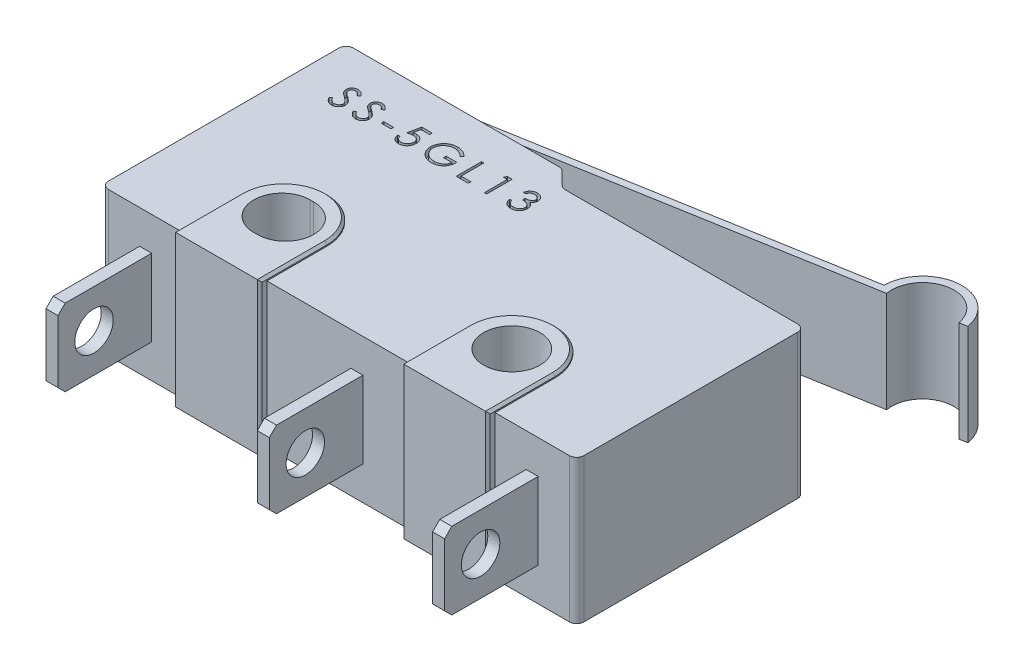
from build123d import *

# Parameters (mm, degrees)
BASE_EXTRUDE_DEPTH       = 6
SKETCH2_R                = 1.175
CUT_EXTRUDE1_DEPTH       = 24.066859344
BOSS_EXTRUDE1_START      = 0.15
SKETCH3_R                = 1.175
BOSS_EXTRUDE1_DEPTH      = 0.15
SKETCH4_R                = 1.175
BOSS_EXTRUDE2_DEPTH      = 0.15
CHAMFER1_SIZE            = 0.1
SKETCH5_W                = 2
SKETCH5_H                = 3.2
BOSS_EXTRUDE3_DEPTH      = 1.2
FILLET1_R                = 0.7
SKETCH6_W                = 0.5
SKETCH6_H                = 3.2
BOSS_EXTRUDE4_DEPTH      = 3.9
CHAMFER2_SIZE            = 0.3
SKETCH7_R                = 0.8
CUT_EXTRUDE2_DEPTH       = 23.338811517
BOSS_EXTRUDE5_DEPTH      = 0.3
CHAMFER3_SIZE            = 0.1
BOSS_EXTRUDE6_DEPTH      = 2.1
BOSS_EXTRUDE6_DEPTH_BACK = 2.1
SKETCH12_W               = 0.407051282
SKETCH12_H               = 0.108547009
CUT_EXTRUDE3_DEPTH       = 0.3


with BuildPart() as part:
    # Sketch1 → Base-Extrude (new body)
    with BuildSketch(Plane(origin=(0, 0, 0), x_dir=(1, 0, 0), z_dir=(0, 1, 0))):
        with BuildLine():
            Line((19.5, 9.5), (9.824264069, 9.5))
            ThreePointArc((9.824264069, 9.5), (9.709459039, 9.52283614), (9.612132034, 9.587867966))
            Line((9.612132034, 9.587867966), (9.087867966, 10.112132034))
            ThreePointArc((9.087867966, 10.112132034), (8.990540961, 10.17716386), (8.875735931, 10.2))
            Line((8.875735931, 10.2), (0.3, 10.2))
            ThreePointArc((0.3, 10.2), (0.087867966, 10.112132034), (0, 9.9))
            Line((0, 9.9), (0, 0.3))
            ThreePointArc((0, 0.3), (0.087867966, 0.087867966), (0.3, 0))
            Line((0.3, 0), (19.5, 0))
            ThreePointArc((19.5, 0), (19.712132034, 0.087867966), (19.8, 0.3))
            Line((19.8, 0.3), (19.8, 9.2))
            ThreePointArc((19.8, 9.2), (19.712132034, 9.412132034), (19.5, 9.5))
        make_face()
    extrude(amount=BASE_EXTRUDE_DEPTH)

    # Sketch2 → Cut-Extrude1 (cut, through all)
    with BuildSketch(Plane(origin=(0, 6, 0), x_dir=(-1, 0, 0), z_dir=(0, 1, 0))):
        with Locations(Location((-14.6, -2.5, 0), (0, 0, 90))):
            Circle(SKETCH2_R)
        with BuildLine():
            Line((-5.025, -3.675), (-5.175, -3.675))
            ThreePointArc((-5.175, -3.675), (-6.35, -2.5), (-5.175, -1.325))
            Line((-5.175, -1.325), (-5.025, -1.325))
            ThreePointArc((-5.025, -1.325), (-3.85, -2.5), (-5.025, -3.675))
        make_face()
    extrude(amount=-CUT_EXTRUDE1_DEPTH, mode=Mode.SUBTRACT)

    # Sketch3 → Boss-Extrude1 (add)
    # profile 1 of 2: a face of its own
    with BuildSketch(Plane(origin=(0, 6, 0), x_dir=(-1, 0, 0), z_dir=(0, 1, 0)).offset(BOSS_EXTRUDE1_START)):
        with BuildLine():
            Line((-3.3, 0), (-6.9, 0))
            Line((-6.9, 0), (-6.9, -2.5))
            ThreePointArc((-6.9, -2.5), (-5.1, -4.3), (-3.3, -2.5))
            Line((-3.3, -2.5), (-3.3, 0))
        make_face()
        with BuildLine():
            Line((-5.175, -3.675), (-5.025, -3.675))
            ThreePointArc((-5.025, -3.675), (-3.85, -2.5), (-5.025, -1.325))
            Line((-5.025, -1.325), (-5.175, -1.325))
            ThreePointArc((-5.175, -1.325), (-6.35, -2.5), (-5.175, -3.675))
        make_face(mode=Mode.SUBTRACT)
    # profile 2 of 2: a face of its own
    with BuildSketch(Plane(origin=(0, 6, 0), x_dir=(-1, 0, 0), z_dir=(0, 1, 0)).offset(BOSS_EXTRUDE1_START)):
        with BuildLine():
            Line((-12.8, -2.5), (-12.8, 0))
            Line((-12.8, 0), (-16.4, 0))
            Line((-16.4, 0), (-16.4, -2.5))
            ThreePointArc((-16.4, -2.5), (-14.6, -4.3), (-12.8, -2.5))
        make_face()
        with Locations(Location((-14.6, -2.5, 0), (0, 0, 90))):
            Circle(SKETCH3_R, mode=Mode.SUBTRACT)
    extrude(amount=-BOSS_EXTRUDE1_DEPTH)

    # Sketch4 → Boss-Extrude2 (add)
    # profile 1 of 2: a face of its own
    with BuildSketch(Plane.XZ):
        with BuildLine():
            Line((16.4, 0), (12.8, 0))
            Line((12.8, 0), (12.8, -2.5))
            ThreePointArc((12.8, -2.5), (14.6, -4.3), (16.4, -2.5))
            Line((16.4, -2.5), (16.4, 0))
        make_face()
        with Locations(Location((14.6, -2.5, 0), (0, 0, 90))):
            Circle(SKETCH4_R, mode=Mode.SUBTRACT)
    # profile 2 of 2: a face of its own
    with BuildSketch(Plane.XZ):
        with BuildLine():
            Line((3.3, 0), (3.3, -2.5))
            ThreePointArc((3.3, -2.5), (5.1, -4.3), (6.9, -2.5))
            Line((6.9, -2.5), (6.9, 0))
            Line((6.9, 0), (3.3, 0))
        make_face()
        with BuildLine():
            Line((5.025, -1.325), (5.175, -1.325))
            ThreePointArc((5.175, -1.325), (6.35, -2.5), (5.175, -3.675))
            Line((5.175, -3.675), (5.025, -3.675))
            ThreePointArc((5.025, -3.675), (3.85, -2.5), (5.025, -1.325))
        make_face(mode=Mode.SUBTRACT)
    extrude(amount=BOSS_EXTRUDE2_DEPTH)

    # Chamfer1
    chamfer1_edges = [part.edges().sort_by_distance(p)[0] for p in [
        (5.1, -0.15, -4.3),
        (6.9, -0.15, -1.25),
        (3.3, -0.15, -1.25),
        (3.3, 6.15, -1.25),
        (6.9, 6.15, -1.25),
        (5.1, 6.15, -4.3),
        (16.4, 6.15, -1.25),
        (14.6, 6.15, -4.3),
        (12.8, 6.15, -1.25),
        (12.8, -0.15, -1.25),
        (14.6, -0.15, -4.3),
        (16.4, -0.15, -1.25),
    ]]
    chamfer(chamfer1_edges, length=CHAMFER1_SIZE)

    # Sketch5 → Boss-Extrude3 (add)
    with BuildSketch(Plane(origin=(0, 0, -10.2), x_dir=(-1, 0, 0), z_dir=(0, 0, -1))):
        with Locations((-7.1, 3)):
            Rectangle(SKETCH5_W, SKETCH5_H)
    extrude(amount=BOSS_EXTRUDE3_DEPTH)

    # Fillet1
    fillet1_edges = [part.edges().sort_by_distance(p)[0] for p in [
        (8.1, 3, -11.4),
        (6.1, 3, -11.4),
    ]]
    fillet(fillet1_edges, radius=FILLET1_R)

    # Sketch6 → Boss-Extrude4 (add)
    with BuildSketch(Plane.XY):
        with Locations((1.85, 3)):
            Rectangle(SKETCH6_W, SKETCH6_H)
        with Locations((10.65, 3)):
            Rectangle(SKETCH6_W, SKETCH6_H)
        with Locations((17.95, 3)):
            Rectangle(SKETCH6_W, SKETCH6_H)
    extrude(amount=BOSS_EXTRUDE4_DEPTH)

    # Chamfer2
    chamfer2_edges = [part.edges().sort_by_distance(p)[0] for p in [
        (1.85, 1.4, 3.9),
        (1.85, 4.6, 3.9),
        (10.65, 1.4, 3.9),
        (10.65, 4.6, 3.9),
        (17.95, 1.4, 3.9),
        (17.95, 4.6, 3.9),
    ]]
    chamfer(chamfer2_edges, length=CHAMFER2_SIZE)

    # Sketch7 → Cut-Extrude2 (cut, through all)
    with BuildSketch(Plane.ZY.offset(-1.6)):
        with Locations((2.4, 3)):
            Circle(SKETCH7_R)
    extrude(amount=-CUT_EXTRUDE2_DEPTH, mode=Mode.SUBTRACT)

    # Sketch8 → Boss-Extrude5 (add)
    with BuildSketch(Plane.XY):
        Polygon((16.4, -0.05), (16.4, 6.05), (16.3, 6.15), (12.9, 6.15), (12.8, 6.05), (12.8, -0.05), (12.9, -0.15), (16.3, -0.15), align=None)
        Polygon((6.9, -0.05), (6.9, 6.05), (6.8, 6.15), (3.4, 6.15), (3.3, 6.05), (3.3, -0.05), (3.4, -0.15), (6.8, -0.15), align=None)
    extrude(amount=BOSS_EXTRUDE5_DEPTH)

    # Chamfer3
    chamfer3_edges = [part.edges().sort_by_distance(p)[0] for p in [
        (12.8, 3, 0.3),
        (16.4, 3, 0.3),
        (3.3, 3, 0.3),
        (6.9, 3, 0.3),
    ]]
    chamfer(chamfer3_edges, length=CHAMFER3_SIZE)

    # Sketch11 → Boss-Extrude6 (add, two sides: drawn at the far end of the back side and taken through both)
    with BuildSketch(Plane(origin=(0, 3, 0), x_dir=(-1, 0, 0), z_dir=(0, 1, 0)).offset(-BOSS_EXTRUDE6_DEPTH_BACK)):
        with BuildLine():
            Line((-19.005311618, -13.6), (-2.948383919, -10.795526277))
            ThreePointArc((-2.948383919, -10.795526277), (-2.770342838, -10.693022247), (-2.7, -10.5))
            Line((-2.7, -10.5), (-2.7, -10.2))
            Line((-2.7, -10.2), (-3, -10.2))
            Line((-3, -10.2), (-3, -10.5))
            Line((-3, -10.5), (-19.056927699, -13.304473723))
            Line((-19.056927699, -13.304473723), (-19.352453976, -13.356089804))
            ThreePointArc((-19.352453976, -13.356089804), (-20.409398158, -14.860373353), (-21.913681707, -13.803429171))
            Line((-21.913681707, -13.803429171), (-22.236674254, -13.859842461))
            ThreePointArc((-22.236674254, -13.859842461), (-20.502586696, -15.202403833), (-19.005311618, -13.6))
        make_face()
    extrude(amount=BOSS_EXTRUDE6_DEPTH + BOSS_EXTRUDE6_DEPTH_BACK)

    # Sketch12 → Cut-Extrude3 (cut)
    with BuildSketch(Plane(origin=(-12.497117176, 6, -3.291404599), x_dir=(1, 0, 0), z_dir=(0, 1, 0))):
        with BuildLine():
            Line((14.069489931, 4.629493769), (14.158956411, 4.683131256))
            add(Edge.make_bspline(
                [(14.158956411, 4.683131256), (14.167277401, 4.669202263), (14.183220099, 4.642514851), (14.209814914, 4.606453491), (14.237371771, 4.575803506), (14.266094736, 4.550743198), (14.295808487, 4.531013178), (14.326706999, 4.517042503), (14.358686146, 4.508329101), (14.380449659, 4.507270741), (14.391314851, 4.506742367)],
                knots=[0, 0, 0, 0, 1.272034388, 2.437168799, 3.508375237, 4.49857839, 5.41946034, 6.295179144, 7.148887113, 8, 8, 8, 8], degree=3))
            add(Edge.make_bspline(
                [(14.391314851, 4.506742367), (14.400593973, 4.507000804), (14.418989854, 4.507513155), (14.446071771, 4.512436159), (14.472373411, 4.519999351), (14.497352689, 4.530830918), (14.520664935, 4.543935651), (14.541107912, 4.559764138), (14.558780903, 4.577485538), (14.573237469, 4.597256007), (14.584328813, 4.618518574), (14.592853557, 4.640343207), (14.597584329, 4.66307275), (14.598296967, 4.67837639), (14.598656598, 4.686099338)],
                knots=[0, 0, 0, 0, 1.095163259, 2.171163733, 3.241058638, 4.321873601, 5.38011039, 6.391990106, 7.366004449, 8.327778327, 9.272591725, 10.192022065, 11.087607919, 12, 12, 12, 12], degree=3))
            add(Edge.make_bspline(
                [(14.598656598, 4.686099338), (14.598210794, 4.694910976), (14.597304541, 4.712823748), (14.589644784, 4.739251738), (14.577595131, 4.765405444), (14.566478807, 4.781583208), (14.560707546, 4.789982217)],
                knots=[0, 0, 0, 0, 0.938893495, 1.908633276, 2.914225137, 4, 4, 4, 4], degree=3))
            add(Edge.make_bspline(
                [(14.560707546, 4.789982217), (14.555969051, 4.796043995), (14.546021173, 4.808769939), (14.528919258, 4.827712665), (14.508851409, 4.847252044), (14.486504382, 4.868134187), (14.461064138, 4.889387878), (14.433327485, 4.912026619), (14.402586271, 4.935189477), (14.381026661, 4.950723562), (14.369902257, 4.958738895)],
                knots=[0, 0, 0, 0, 0.722233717, 1.516239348, 2.393582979, 3.351407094, 4.387010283, 5.505090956, 6.712668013, 8, 8, 8, 8], degree=3))
            add(Edge.make_bspline(
                [(14.369902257, 4.958738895), (14.358767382, 4.96666992), (14.337478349, 4.981833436), (14.307706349, 5.004337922), (14.281083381, 5.024913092), (14.257727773, 5.043752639), (14.2376498, 5.060859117), (14.220691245, 5.076068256), (14.20728411, 5.08979138), (14.199828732, 5.098693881), (14.196481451, 5.102690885)],
                knots=[0, 0, 0, 0, 1.452282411, 2.77665338, 3.964542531, 5.026858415, 5.96415736, 6.766646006, 7.446254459, 8, 8, 8, 8], degree=3))
            add(Edge.make_bspline(
                [(14.196481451, 5.102690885), (14.191802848, 5.108920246), (14.182601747, 5.12117112), (14.170456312, 5.140319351), (14.16013328, 5.159920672), (14.15204086, 5.180027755), (14.145226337, 5.200358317), (14.140642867, 5.221177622), (14.13777285, 5.242392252), (14.137478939, 5.256668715), (14.137331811, 5.26381535)],
                knots=[0, 0, 0, 0, 1.068054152, 2.10047183, 3.106115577, 4.101338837, 5.06977816, 6.043150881, 7.020423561, 8, 8, 8, 8], degree=3))
            add(Edge.make_bspline(
                [(14.137331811, 5.26381535), (14.137726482, 5.275012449), (14.138507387, 5.297167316), (14.145111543, 5.3295314), (14.155535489, 5.360430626), (14.170138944, 5.389559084), (14.188964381, 5.416158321), (14.210749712, 5.440534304), (14.236697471, 5.461026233), (14.26516743, 5.478930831), (14.296329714, 5.492944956), (14.328984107, 5.503516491), (14.363182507, 5.509506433), (14.386345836, 5.510366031), (14.398099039, 5.510802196)],
                knots=[0, 0, 0, 0, 1.005424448, 1.989358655, 2.955360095, 3.929531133, 4.905563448, 5.876582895, 6.856512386, 7.866279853, 8.892233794, 9.918561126, 10.94386622, 12, 12, 12, 12], degree=3))
            add(Edge.make_bspline(
                [(14.398099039, 5.510802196), (14.410570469, 5.510372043), (14.435372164, 5.509516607), (14.471854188, 5.502078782), (14.506978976, 5.489771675), (14.53523444, 5.475805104), (14.557348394, 5.461855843), (14.574213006, 5.449149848), (14.591302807, 5.434522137), (14.608755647, 5.417933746), (14.626275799, 5.399232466), (14.644123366, 5.378546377), (14.662340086, 5.356001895), (14.67405912, 5.339907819), (14.680066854, 5.331657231)],
                knots=[0, 0, 0, 0, 1.286793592, 2.559021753, 3.825965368, 5.121522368, 5.803751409, 6.523245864, 7.299691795, 8.125521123, 9.008227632, 9.944561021, 10.946284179, 12, 12, 12, 12], degree=3))
            Line((14.680066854, 5.331657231), (14.594204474, 5.266571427))
            add(Edge.make_bspline(
                [(14.594204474, 5.266571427), (14.589019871, 5.273250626), (14.579035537, 5.286113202), (14.563877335, 5.304126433), (14.549590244, 5.32058094), (14.53551429, 5.334873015), (14.522392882, 5.347785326), (14.509657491, 5.3588403), (14.497491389, 5.368146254), (14.482155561, 5.378077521), (14.462888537, 5.387921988), (14.438702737, 5.396252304), (14.413427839, 5.40125824), (14.396213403, 5.401920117), (14.387498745, 5.402255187)],
                knots=[0, 0, 0, 0, 1.181633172, 2.275549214, 3.290209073, 4.226197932, 5.078386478, 5.862611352, 6.581680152, 7.217281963, 8.414376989, 9.595101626, 10.782541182, 12, 12, 12, 12], degree=3))
            add(Edge.make_bspline(
                [(14.387498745, 5.402255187), (14.376565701, 5.401888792), (14.355482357, 5.401182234), (14.325549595, 5.393465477), (14.298609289, 5.381315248), (14.275461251, 5.364286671), (14.256188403, 5.344111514), (14.242246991, 5.32089505), (14.23385587, 5.295258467), (14.232831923, 5.277375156), (14.232310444, 5.268267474)],
                knots=[0, 0, 0, 0, 1.14458467, 2.207223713, 3.21896685, 4.227309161, 5.202851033, 6.127160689, 7.046193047, 8, 8, 8, 8], degree=3))
            add(Edge.make_bspline(
                [(14.232310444, 5.268267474), (14.232429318, 5.262597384), (14.23266726, 5.251247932), (14.23598583, 5.234480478), (14.240249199, 5.217755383), (14.247005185, 5.20114784), (14.256332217, 5.184367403), (14.268580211, 5.167125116), (14.284005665, 5.149269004), (14.295821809, 5.137655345), (14.302060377, 5.131523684)],
                knots=[0, 0, 0, 0, 0.858281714, 1.717966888, 2.583508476, 3.4729293, 4.427298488, 5.488583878, 6.674047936, 8, 8, 8, 8], degree=3))
            add(Edge.make_bspline(
                [(14.302060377, 5.131523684), (14.30437703, 5.129456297), (14.309880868, 5.12454466), (14.319942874, 5.116503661), (14.333230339, 5.106584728), (14.34939629, 5.094311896), (14.368738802, 5.080075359), (14.391260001, 5.064057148), (14.416708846, 5.045737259), (14.434767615, 5.032929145), (14.44431632, 5.026156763)],
                knots=[0, 0, 0, 0, 0.420754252, 0.999615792, 1.744751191, 2.668019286, 3.750313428, 4.999500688, 6.413464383, 8, 8, 8, 8], degree=3))
            add(Edge.make_bspline(
                [(14.44431632, 5.026156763), (14.455802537, 5.017798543), (14.478044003, 5.001614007), (14.509690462, 4.977297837), (14.538384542, 4.95351625), (14.564226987, 4.930421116), (14.5874731, 4.908187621), (14.607864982, 4.886548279), (14.625610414, 4.865658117), (14.644714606, 4.838875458), (14.664235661, 4.80598213), (14.681000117, 4.765681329), (14.691570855, 4.72522387), (14.692953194, 4.698031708), (14.69363523, 4.684615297)],
                knots=[0, 0, 0, 0, 1.163667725, 2.253281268, 3.268753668, 4.215851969, 5.092017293, 5.902905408, 6.650798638, 7.335211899, 8.59617414, 9.77448103, 10.901945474, 12, 12, 12, 12], degree=3))
            add(Edge.make_bspline(
                [(14.69363523, 4.684615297), (14.693436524, 4.675127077), (14.693042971, 4.656334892), (14.688519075, 4.628741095), (14.681890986, 4.601940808), (14.671901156, 4.576265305), (14.659708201, 4.551244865), (14.644236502, 4.527535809), (14.626302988, 4.504613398), (14.605730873, 4.483088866), (14.58321985, 4.463329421), (14.5594274, 4.4457523), (14.534314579, 4.431096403), (14.508017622, 4.419136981), (14.480530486, 4.409783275), (14.451862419, 4.40300605), (14.421966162, 4.398846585), (14.401646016, 4.398414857), (14.391314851, 4.398195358)],
                knots=[0, 0, 0, 0, 0.983748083, 1.948392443, 2.894712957, 3.844097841, 4.80183111, 5.778335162, 6.776009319, 7.81870978, 8.863265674, 9.881300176, 10.883814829, 11.87499822, 12.874611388, 13.892143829, 14.928324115, 16, 16, 16, 16], degree=3))
            add(Edge.make_bspline(
                [(14.391314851, 4.398195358), (14.383321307, 4.39834993), (14.367434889, 4.398657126), (14.343937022, 4.401372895), (14.32091386, 4.405215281), (14.298654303, 4.411315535), (14.276871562, 4.418716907), (14.255660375, 4.427830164), (14.235010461, 4.438751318), (14.214806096, 4.451238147), (14.195098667, 4.465769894), (14.176073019, 4.482695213), (14.157104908, 4.501547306), (14.138754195, 4.522838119), (14.120649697, 4.546223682), (14.103148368, 4.571922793), (14.085887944, 4.599795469), (14.075058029, 4.619409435), (14.069489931, 4.629493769)],
                knots=[0, 0, 0, 0, 0.915332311, 1.819136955, 2.706846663, 3.586547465, 4.459518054, 5.340707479, 6.227863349, 7.133153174, 8.059268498, 9.028702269, 10.047606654, 11.120612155, 12.245963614, 13.433783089, 14.680604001, 16, 16, 16, 16], degree=3))
        make_face()
        with BuildLine():
            Line((15.070836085, 4.629493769), (15.160302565, 4.683131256))
            add(Edge.make_bspline(
                [(15.160302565, 4.683131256), (15.168623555, 4.669202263), (15.184566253, 4.642514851), (15.211161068, 4.606453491), (15.238717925, 4.575803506), (15.26744089, 4.550743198), (15.297154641, 4.531013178), (15.328053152, 4.517042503), (15.3600323, 4.508329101), (15.381795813, 4.507270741), (15.392661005, 4.506742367)],
                knots=[0, 0, 0, 0, 1.272034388, 2.437168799, 3.508375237, 4.49857839, 5.41946034, 6.295179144, 7.148887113, 8, 8, 8, 8], degree=3))
            add(Edge.make_bspline(
                [(15.392661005, 4.506742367), (15.401940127, 4.507000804), (15.420336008, 4.507513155), (15.447417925, 4.512436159), (15.473719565, 4.519999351), (15.498698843, 4.530830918), (15.522011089, 4.543935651), (15.542454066, 4.559764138), (15.560127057, 4.577485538), (15.574583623, 4.597256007), (15.585674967, 4.618518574), (15.594199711, 4.640343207), (15.598930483, 4.66307275), (15.599643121, 4.67837639), (15.600002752, 4.686099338)],
                knots=[0, 0, 0, 0, 1.095163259, 2.171163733, 3.241058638, 4.321873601, 5.38011039, 6.391990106, 7.366004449, 8.327778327, 9.272591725, 10.192022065, 11.087607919, 12, 12, 12, 12], degree=3))
            add(Edge.make_bspline(
                [(15.600002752, 4.686099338), (15.599556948, 4.694910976), (15.598650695, 4.712823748), (15.590990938, 4.739251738), (15.578941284, 4.765405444), (15.567824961, 4.781583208), (15.5620537, 4.789982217)],
                knots=[0, 0, 0, 0, 0.938893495, 1.908633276, 2.914225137, 4, 4, 4, 4], degree=3))
            add(Edge.make_bspline(
                [(15.5620537, 4.789982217), (15.557315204, 4.796043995), (15.547367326, 4.808769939), (15.530265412, 4.827712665), (15.510197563, 4.847252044), (15.487850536, 4.868134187), (15.462410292, 4.889387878), (15.434673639, 4.912026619), (15.403932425, 4.935189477), (15.382372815, 4.950723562), (15.371248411, 4.958738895)],
                knots=[0, 0, 0, 0, 0.722233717, 1.516239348, 2.393582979, 3.351407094, 4.387010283, 5.505090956, 6.712668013, 8, 8, 8, 8], degree=3))
            add(Edge.make_bspline(
                [(15.371248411, 4.958738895), (15.360113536, 4.96666992), (15.338824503, 4.981833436), (15.309052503, 5.004337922), (15.282429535, 5.024913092), (15.259073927, 5.043752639), (15.238995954, 5.060859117), (15.222037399, 5.076068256), (15.208630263, 5.08979138), (15.201174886, 5.098693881), (15.197827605, 5.102690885)],
                knots=[0, 0, 0, 0, 1.452282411, 2.77665338, 3.964542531, 5.026858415, 5.96415736, 6.766646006, 7.446254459, 8, 8, 8, 8], degree=3))
            add(Edge.make_bspline(
                [(15.197827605, 5.102690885), (15.193149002, 5.108920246), (15.183947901, 5.12117112), (15.171802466, 5.140319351), (15.161479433, 5.159920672), (15.153387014, 5.180027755), (15.146572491, 5.200358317), (15.141989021, 5.221177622), (15.139119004, 5.242392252), (15.138825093, 5.256668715), (15.138677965, 5.26381535)],
                knots=[0, 0, 0, 0, 1.068054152, 2.10047183, 3.106115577, 4.101338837, 5.06977816, 6.043150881, 7.020423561, 8, 8, 8, 8], degree=3))
            add(Edge.make_bspline(
                [(15.138677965, 5.26381535), (15.139072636, 5.275012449), (15.13985354, 5.297167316), (15.146457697, 5.3295314), (15.156881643, 5.360430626), (15.171485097, 5.389559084), (15.190310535, 5.416158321), (15.212095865, 5.440534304), (15.238043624, 5.461026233), (15.266513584, 5.478930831), (15.297675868, 5.492944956), (15.33033026, 5.503516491), (15.364528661, 5.509506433), (15.38769199, 5.510366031), (15.399445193, 5.510802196)],
                knots=[0, 0, 0, 0, 1.005424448, 1.989358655, 2.955360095, 3.929531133, 4.905563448, 5.876582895, 6.856512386, 7.866279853, 8.892233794, 9.918561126, 10.94386622, 12, 12, 12, 12], degree=3))
            add(Edge.make_bspline(
                [(15.399445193, 5.510802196), (15.411916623, 5.510372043), (15.436718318, 5.509516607), (15.473200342, 5.502078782), (15.50832513, 5.489771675), (15.536580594, 5.475805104), (15.558694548, 5.461855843), (15.57555916, 5.449149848), (15.59264896, 5.434522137), (15.610101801, 5.417933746), (15.627621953, 5.399232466), (15.64546952, 5.378546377), (15.66368624, 5.356001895), (15.675405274, 5.339907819), (15.681413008, 5.331657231)],
                knots=[0, 0, 0, 0, 1.286793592, 2.559021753, 3.825965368, 5.121522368, 5.803751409, 6.523245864, 7.299691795, 8.125521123, 9.008227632, 9.944561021, 10.946284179, 12, 12, 12, 12], degree=3))
            Line((15.681413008, 5.331657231), (15.595550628, 5.266571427))
            add(Edge.make_bspline(
                [(15.595550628, 5.266571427), (15.590366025, 5.273250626), (15.580381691, 5.286113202), (15.565223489, 5.304126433), (15.550936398, 5.32058094), (15.536860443, 5.334873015), (15.523739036, 5.347785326), (15.511003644, 5.3588403), (15.498837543, 5.368146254), (15.483501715, 5.378077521), (15.464234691, 5.387921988), (15.440048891, 5.396252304), (15.414773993, 5.40125824), (15.397559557, 5.401920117), (15.388844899, 5.402255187)],
                knots=[0, 0, 0, 0, 1.181633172, 2.275549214, 3.290209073, 4.226197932, 5.078386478, 5.862611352, 6.581680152, 7.217281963, 8.414376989, 9.595101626, 10.782541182, 12, 12, 12, 12], degree=3))
            add(Edge.make_bspline(
                [(15.388844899, 5.402255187), (15.377911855, 5.401888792), (15.35682851, 5.401182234), (15.326895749, 5.393465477), (15.299955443, 5.381315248), (15.276807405, 5.364286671), (15.257534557, 5.344111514), (15.243593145, 5.32089505), (15.235202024, 5.295258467), (15.234178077, 5.277375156), (15.233656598, 5.268267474)],
                knots=[0, 0, 0, 0, 1.14458467, 2.207223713, 3.21896685, 4.227309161, 5.202851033, 6.127160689, 7.046193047, 8, 8, 8, 8], degree=3))
            add(Edge.make_bspline(
                [(15.233656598, 5.268267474), (15.233775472, 5.262597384), (15.234013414, 5.251247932), (15.237331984, 5.234480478), (15.241595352, 5.217755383), (15.248351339, 5.20114784), (15.257678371, 5.184367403), (15.269926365, 5.167125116), (15.285351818, 5.149269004), (15.297167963, 5.137655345), (15.303406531, 5.131523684)],
                knots=[0, 0, 0, 0, 0.858281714, 1.717966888, 2.583508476, 3.4729293, 4.427298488, 5.488583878, 6.674047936, 8, 8, 8, 8], degree=3))
            add(Edge.make_bspline(
                [(15.303406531, 5.131523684), (15.305723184, 5.129456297), (15.311227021, 5.12454466), (15.321289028, 5.116503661), (15.334576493, 5.106584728), (15.350742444, 5.094311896), (15.370084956, 5.080075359), (15.392606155, 5.064057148), (15.418054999, 5.045737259), (15.436113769, 5.032929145), (15.445662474, 5.026156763)],
                knots=[0, 0, 0, 0, 0.420754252, 0.999615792, 1.744751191, 2.668019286, 3.750313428, 4.999500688, 6.413464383, 8, 8, 8, 8], degree=3))
            add(Edge.make_bspline(
                [(15.445662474, 5.026156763), (15.45714869, 5.017798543), (15.479390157, 5.001614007), (15.511036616, 4.977297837), (15.539730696, 4.95351625), (15.565573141, 4.930421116), (15.588819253, 4.908187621), (15.609211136, 4.886548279), (15.626956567, 4.865658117), (15.64606076, 4.838875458), (15.665581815, 4.80598213), (15.682346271, 4.765681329), (15.692917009, 4.72522387), (15.694299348, 4.698031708), (15.694981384, 4.684615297)],
                knots=[0, 0, 0, 0, 1.163667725, 2.253281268, 3.268753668, 4.215851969, 5.092017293, 5.902905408, 6.650798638, 7.335211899, 8.59617414, 9.77448103, 10.901945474, 12, 12, 12, 12], degree=3))
            add(Edge.make_bspline(
                [(15.694981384, 4.684615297), (15.694782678, 4.675127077), (15.694389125, 4.656334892), (15.689865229, 4.628741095), (15.68323714, 4.601940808), (15.67324731, 4.576265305), (15.661054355, 4.551244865), (15.645582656, 4.527535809), (15.627649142, 4.504613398), (15.607077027, 4.483088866), (15.584566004, 4.463329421), (15.560773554, 4.4457523), (15.535660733, 4.431096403), (15.509363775, 4.419136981), (15.48187664, 4.409783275), (15.453208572, 4.40300605), (15.423312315, 4.398846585), (15.40299217, 4.398414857), (15.392661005, 4.398195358)],
                knots=[0, 0, 0, 0, 0.983748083, 1.948392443, 2.894712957, 3.844097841, 4.80183111, 5.778335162, 6.776009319, 7.81870978, 8.863265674, 9.881300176, 10.883814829, 11.87499822, 12.874611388, 13.892143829, 14.928324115, 16, 16, 16, 16], degree=3))
            add(Edge.make_bspline(
                [(15.392661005, 4.398195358), (15.384667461, 4.39834993), (15.368781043, 4.398657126), (15.345283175, 4.401372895), (15.322260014, 4.405215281), (15.300000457, 4.411315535), (15.278217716, 4.418716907), (15.257006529, 4.427830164), (15.236356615, 4.438751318), (15.21615225, 4.451238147), (15.196444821, 4.465769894), (15.177419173, 4.482695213), (15.158451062, 4.501547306), (15.140100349, 4.522838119), (15.121995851, 4.546223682), (15.104494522, 4.571922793), (15.087234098, 4.599795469), (15.076404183, 4.619409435), (15.070836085, 4.629493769)],
                knots=[0, 0, 0, 0, 0.915332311, 1.819136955, 2.706846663, 3.586547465, 4.459518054, 5.340707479, 6.227863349, 7.133153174, 8.059268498, 9.028702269, 10.047606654, 11.120612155, 12.245963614, 13.433783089, 14.680604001, 16, 16, 16, 16], degree=3))
        make_face()
        with Locations((16.289276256, 4.832383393)):
            Rectangle(SKETCH12_W, SKETCH12_H)
        with BuildLine():
            Line((17.507716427, 5.483665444), (17.507716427, 5.375118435))
            Line((17.507716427, 5.375118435), (17.147730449, 5.375118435))
            Line((17.147730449, 5.375118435), (17.090700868, 5.09675472))
            add(Edge.make_bspline(
                [(17.090700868, 5.09675472), (17.101905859, 5.099848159), (17.123613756, 5.105841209), (17.155654, 5.112495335), (17.186071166, 5.116506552), (17.205809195, 5.117054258), (17.215360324, 5.11731929)],
                knots=[0, 0, 0, 0, 1.100273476, 2.13160584, 3.095893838, 4, 4, 4, 4], degree=3))
            add(Edge.make_bspline(
                [(17.215360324, 5.11731929), (17.227178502, 5.117063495), (17.250415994, 5.116560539), (17.28441539, 5.111730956), (17.316870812, 5.104129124), (17.347714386, 5.093509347), (17.377003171, 5.079929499), (17.404467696, 5.062965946), (17.430520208, 5.043149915), (17.454693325, 5.020367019), (17.476623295, 4.995293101), (17.495904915, 4.968333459), (17.512282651, 4.939750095), (17.525454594, 4.909269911), (17.535972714, 4.877229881), (17.542973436, 4.843292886), (17.547635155, 4.807778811), (17.548155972, 4.783496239), (17.548421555, 4.771113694)],
                knots=[0, 0, 0, 0, 1.052922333, 2.070308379, 3.05430497, 4.020497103, 4.973039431, 5.925935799, 6.892292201, 7.88610001, 8.88166317, 9.857072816, 10.836096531, 11.812156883, 12.81219415, 13.836441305, 14.89672472, 16, 16, 16, 16], degree=3))
            add(Edge.make_bspline(
                [(17.548421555, 4.771113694), (17.548220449, 4.762489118), (17.547820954, 4.74535652), (17.545789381, 4.719912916), (17.541877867, 4.695007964), (17.536626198, 4.67063836), (17.529809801, 4.64685024), (17.52155811, 4.623575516), (17.511459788, 4.600959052), (17.500383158, 4.578786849), (17.487911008, 4.557560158), (17.47406846, 4.537709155), (17.459443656, 4.51893605), (17.443707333, 4.501442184), (17.426713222, 4.485342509), (17.408667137, 4.470541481), (17.389713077, 4.456788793), (17.369557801, 4.444642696), (17.348650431, 4.433465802), (17.326689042, 4.424296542), (17.304173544, 4.416098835), (17.28077988, 4.409564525), (17.256561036, 4.404444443), (17.231477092, 4.400966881), (17.205659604, 4.398434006), (17.188159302, 4.39827545), (17.179319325, 4.398195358)],
                knots=[0, 0, 0, 0, 1.056347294, 2.098418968, 3.122841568, 4.141288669, 5.149314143, 6.15115421, 7.162517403, 8.180376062, 9.185164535, 10.17417709, 11.141909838, 12.097768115, 13.052685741, 14.0056014, 14.954263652, 15.917497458, 16.885230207, 17.854509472, 18.828990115, 19.81800267, 20.826176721, 21.857883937, 22.917946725, 24, 24, 24, 24], degree=3))
            add(Edge.make_bspline(
                [(17.179319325, 4.398195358), (17.168774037, 4.398404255), (17.148027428, 4.398815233), (17.117631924, 4.403114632), (17.088387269, 4.409272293), (17.060528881, 4.418536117), (17.033807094, 4.430143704), (17.008581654, 4.44481407), (16.984208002, 4.461438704), (16.961676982, 4.481057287), (16.94076549, 4.502500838), (16.922046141, 4.525771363), (16.905374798, 4.55048479), (16.891018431, 4.576761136), (16.878772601, 4.604531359), (16.869152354, 4.633899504), (16.861387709, 4.664712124), (16.858102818, 4.68592521), (16.856434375, 4.696699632)],
                knots=[0, 0, 0, 0, 1.0467383, 2.05933395, 3.04377827, 4.011590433, 4.970194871, 5.932262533, 6.905835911, 7.896367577, 8.894135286, 9.877477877, 10.858688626, 11.851381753, 12.8477658, 13.868841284, 14.917554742, 16, 16, 16, 16], degree=3))
            Line((16.856434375, 4.696699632), (16.951413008, 4.696699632))
            add(Edge.make_bspline(
                [(16.951413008, 4.696699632), (16.953749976, 4.686607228), (16.95824176, 4.667209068), (16.968101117, 4.639955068), (16.980155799, 4.615668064), (16.994489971, 4.594026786), (17.011589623, 4.575155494), (17.031102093, 4.558337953), (17.052978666, 4.54316595), (17.077288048, 4.530519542), (17.102933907, 4.51973399), (17.129775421, 4.51255193), (17.157081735, 4.507501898), (17.175550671, 4.50699639), (17.184831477, 4.506742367)],
                knots=[0, 0, 0, 0, 1.136247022, 2.183929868, 3.172523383, 4.106158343, 5.02341133, 5.958108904, 6.928429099, 7.938127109, 8.96079061, 9.975095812, 10.982467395, 12, 12, 12, 12], degree=3))
            add(Edge.make_bspline(
                [(17.184831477, 4.506742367), (17.19389034, 4.506990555), (17.211727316, 4.507479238), (17.237977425, 4.511240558), (17.263320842, 4.517033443), (17.287507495, 4.525702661), (17.310960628, 4.53623904), (17.333086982, 4.549760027), (17.354526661, 4.565320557), (17.374613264, 4.583147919), (17.393009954, 4.602793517), (17.409264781, 4.623802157), (17.422804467, 4.64621368), (17.434214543, 4.669640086), (17.442878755, 4.694338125), (17.449059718, 4.720192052), (17.452689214, 4.747265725), (17.4531885, 4.765731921), (17.453442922, 4.775141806)],
                knots=[0, 0, 0, 0, 1.027316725, 2.022795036, 3.002884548, 3.971462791, 4.93288096, 5.914575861, 6.907176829, 7.935150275, 8.956128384, 9.956726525, 10.942570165, 11.921478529, 12.907843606, 13.90538589, 14.932640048, 16, 16, 16, 16], degree=3))
            add(Edge.make_bspline(
                [(17.453442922, 4.775141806), (17.453243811, 4.783631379), (17.452854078, 4.800248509), (17.449669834, 4.824559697), (17.444131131, 4.847562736), (17.436443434, 4.869368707), (17.426682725, 4.889998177), (17.414754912, 4.909472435), (17.400436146, 4.927534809), (17.384079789, 4.944193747), (17.366161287, 4.959568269), (17.346372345, 4.972674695), (17.325127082, 4.983700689), (17.302681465, 4.993216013), (17.278501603, 5.000050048), (17.253066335, 5.005180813), (17.226100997, 5.008148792), (17.207664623, 5.008560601), (17.198187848, 5.008772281)],
                knots=[0, 0, 0, 0, 1.045622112, 2.046656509, 3.013763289, 3.955457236, 4.890082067, 5.820317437, 6.762574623, 7.722996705, 8.69280354, 9.665887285, 10.63943826, 11.638615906, 12.663482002, 13.728887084, 14.832589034, 16, 16, 16, 16], degree=3))
            add(Edge.make_bspline(
                [(17.198187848, 5.008772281), (17.189984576, 5.008596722), (17.173046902, 5.008234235), (17.147065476, 5.005565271), (17.119762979, 5.00125958), (17.091244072, 4.995337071), (17.061423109, 4.987586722), (17.030363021, 4.978299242), (16.997998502, 4.967195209), (16.976191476, 4.958809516), (16.964981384, 4.954498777)],
                knots=[0, 0, 0, 0, 0.817624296, 1.688186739, 2.600797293, 3.572016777, 4.590301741, 5.671205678, 6.80286297, 8, 8, 8, 8], degree=3))
            Line((16.964981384, 4.954498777), (17.073528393, 5.483665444))
            Line((17.073528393, 5.483665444), (17.507716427, 5.483665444))
        make_face()
        with BuildLine():
            Line((19.011092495, 5.303036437), (18.929682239, 5.225866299))
            add(Edge.make_bspline(
                [(18.929682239, 5.225866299), (18.914950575, 5.239724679), (18.885838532, 5.267110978), (18.838376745, 5.302644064), (18.788857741, 5.333083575), (18.737539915, 5.357850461), (18.685694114, 5.377611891), (18.634008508, 5.391681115), (18.58301326, 5.400653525), (18.549096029, 5.401726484), (18.532383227, 5.402255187)],
                knots=[0, 0, 0, 0, 1.08915593, 2.152340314, 3.188132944, 4.216796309, 5.218260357, 6.173443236, 7.099959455, 8, 8, 8, 8], degree=3))
            add(Edge.make_bspline(
                [(18.532383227, 5.402255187), (18.522128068, 5.402130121), (18.501644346, 5.401880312), (18.471218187, 5.398691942), (18.441111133, 5.394106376), (18.411380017, 5.38747157), (18.381967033, 5.37906264), (18.352974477, 5.368544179), (18.324348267, 5.356281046), (18.296358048, 5.342110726), (18.269222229, 5.326544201), (18.243593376, 5.309293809), (18.219308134, 5.290912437), (18.196822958, 5.270939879), (18.176008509, 5.249557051), (18.156369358, 5.227161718), (18.138596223, 5.20314202), (18.122542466, 5.177939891), (18.108221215, 5.151997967), (18.095579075, 5.125565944), (18.084966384, 5.098731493), (18.076569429, 5.07146094), (18.069641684, 5.043965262), (18.064768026, 5.016054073), (18.062020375, 4.987697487), (18.061545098, 4.968708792), (18.06130617, 4.959162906)],
                knots=[0, 0, 0, 0, 1.02818874, 2.053710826, 3.065248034, 4.081641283, 5.106893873, 6.131558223, 7.173050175, 8.228653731, 9.27666206, 10.308777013, 11.325269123, 12.329503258, 13.32196095, 14.316845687, 15.314881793, 16.315733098, 17.311955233, 18.285320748, 19.252783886, 20.203351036, 21.145449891, 22.095197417, 23.042428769, 24, 24, 24, 24], degree=3))
            add(Edge.make_bspline(
                [(18.06130617, 4.959162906), (18.061534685, 4.949404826), (18.061991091, 4.929915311), (18.064912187, 4.900828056), (18.070333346, 4.872172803), (18.077580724, 4.843855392), (18.086646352, 4.815827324), (18.097947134, 4.788210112), (18.111332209, 4.76100478), (18.126825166, 4.734456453), (18.143814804, 4.70859592), (18.162847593, 4.684236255), (18.18306496, 4.661053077), (18.205203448, 4.63956112), (18.228553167, 4.619185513), (18.253811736, 4.600487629), (18.28048248, 4.583107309), (18.30860609, 4.5672636), (18.337877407, 4.55310959), (18.367890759, 4.540523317), (18.398742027, 4.530157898), (18.430269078, 4.521709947), (18.462434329, 4.514785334), (18.495401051, 4.510330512), (18.528926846, 4.507097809), (18.551526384, 4.506861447), (18.562912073, 4.506742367)],
                knots=[0, 0, 0, 0, 0.93586088, 1.869166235, 2.799637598, 3.729985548, 4.670839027, 5.622275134, 6.589130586, 7.576015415, 8.568469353, 9.55398029, 10.53834874, 11.515998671, 12.510579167, 13.508179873, 14.527009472, 15.561807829, 16.601455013, 17.643573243, 18.680854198, 19.719860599, 20.772568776, 21.833555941, 22.908541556, 24, 24, 24, 24], degree=3))
            add(Edge.make_bspline(
                [(18.562912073, 4.506742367), (18.576633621, 4.507029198), (18.603578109, 4.507592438), (18.643185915, 4.51197705), (18.681226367, 4.518825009), (18.717592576, 4.528853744), (18.75232678, 4.54164557), (18.785556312, 4.557065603), (18.817019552, 4.57570529), (18.846811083, 4.596743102), (18.874254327, 4.620182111), (18.899005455, 4.645474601), (18.920669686, 4.672497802), (18.939569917, 4.701092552), (18.955205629, 4.731495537), (18.968039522, 4.763557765), (18.97787697, 4.797293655), (18.98191526, 4.820604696), (18.983955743, 4.832383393)],
                knots=[0, 0, 0, 0, 1.13008108, 2.219097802, 3.278683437, 4.311054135, 5.322181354, 6.324827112, 7.324222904, 8.330512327, 9.32562643, 10.293043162, 11.24128371, 12.174520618, 13.111833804, 14.052305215, 15.015860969, 16, 16, 16, 16], degree=3))
            Line((18.983955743, 4.832383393), (18.631177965, 4.832383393))
            Line((18.631177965, 4.832383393), (18.631177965, 4.940930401))
            Line((18.631177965, 4.940930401), (19.078934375, 4.940930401))
            add(Edge.make_bspline(
                [(19.078934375, 4.940930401), (19.078418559, 4.920698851), (19.077409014, 4.881102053), (19.07032758, 4.82335628), (19.058892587, 4.768815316), (19.043271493, 4.71742172), (19.023049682, 4.669248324), (18.998444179, 4.624246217), (18.969061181, 4.582706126), (18.935947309, 4.544288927), (18.898784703, 4.510020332), (18.858577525, 4.479901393), (18.815259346, 4.454530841), (18.768871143, 4.433890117), (18.719564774, 4.417781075), (18.667226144, 4.40635967), (18.611926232, 4.3995168), (18.574026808, 4.398642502), (18.554643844, 4.398195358)],
                knots=[0, 0, 0, 0, 1.140356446, 2.231883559, 3.274166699, 4.278491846, 5.25512956, 6.21435461, 7.1637429, 8.11826594, 9.068280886, 10.0076534, 10.945064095, 11.891975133, 12.864533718, 13.863980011, 14.907571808, 16, 16, 16, 16], degree=3))
            add(Edge.make_bspline(
                [(18.554643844, 4.398195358), (18.542696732, 4.39836745), (18.519133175, 4.39870687), (18.484331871, 4.401119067), (18.450490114, 4.40483248), (18.417612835, 4.410440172), (18.385579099, 4.417308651), (18.354548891, 4.42610392), (18.324404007, 4.436284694), (18.295097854, 4.447864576), (18.266896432, 4.46128172), (18.239674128, 4.476192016), (18.213280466, 4.492518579), (18.187895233, 4.510543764), (18.163386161, 4.530132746), (18.139911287, 4.551324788), (18.11733919, 4.574055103), (18.103199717, 4.590195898), (18.096075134, 4.598328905)],
                knots=[0, 0, 0, 0, 1.107784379, 2.184907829, 3.233506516, 4.263428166, 5.276301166, 6.270063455, 7.25232949, 8.225834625, 9.190232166, 10.146266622, 11.1027726, 12.066435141, 13.031522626, 14.010570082, 14.99756817, 16, 16, 16, 16], degree=3))
            add(Edge.make_bspline(
                [(18.096075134, 4.598328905), (18.085737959, 4.611231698), (18.065235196, 4.63682311), (18.038843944, 4.677825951), (18.016346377, 4.720280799), (17.998092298, 4.764305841), (17.983838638, 4.809859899), (17.973616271, 4.85688476), (17.967626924, 4.905440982), (17.966764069, 4.938299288), (17.966327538, 4.954922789)],
                knots=[0, 0, 0, 0, 1.023165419, 2.029347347, 3.013907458, 3.994755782, 4.975994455, 5.96558838, 6.970761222, 8, 8, 8, 8], degree=3))
            add(Edge.make_bspline(
                [(17.966327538, 4.954922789), (17.966488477, 4.96737068), (17.966808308, 4.992108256), (17.9706865, 5.028834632), (17.976250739, 5.064908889), (17.984429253, 5.100301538), (17.994739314, 5.135036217), (18.007606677, 5.169129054), (18.02258811, 5.202600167), (18.040000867, 5.23521917), (18.059378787, 5.266553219), (18.080409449, 5.296476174), (18.10339149, 5.324443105), (18.127949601, 5.350808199), (18.154376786, 5.375240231), (18.182425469, 5.397965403), (18.212117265, 5.419014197), (18.243545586, 5.438055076), (18.276241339, 5.455158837), (18.310126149, 5.47015367), (18.345189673, 5.482546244), (18.381169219, 5.493061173), (18.41833713, 5.500836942), (18.456423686, 5.506475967), (18.49562741, 5.510334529), (18.522126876, 5.510644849), (18.535563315, 5.510802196)],
                knots=[0, 0, 0, 0, 1.008945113, 2.00506715, 2.99143336, 3.967273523, 4.948097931, 5.927297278, 6.919902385, 7.919676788, 8.923139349, 9.905703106, 10.883022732, 11.856032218, 12.825136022, 13.798837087, 14.781400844, 15.773989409, 16.776158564, 17.77167057, 18.775803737, 19.789618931, 20.80898985, 21.851988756, 22.910860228, 24, 24, 24, 24], degree=3))
            add(Edge.make_bspline(
                [(18.535563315, 5.510802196), (18.54652107, 5.510626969), (18.568249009, 5.510279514), (18.600581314, 5.507871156), (18.632413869, 5.504053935), (18.663793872, 5.498844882), (18.694614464, 5.491749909), (18.724963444, 5.483259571), (18.754884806, 5.473374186), (18.784284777, 5.461584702), (18.813361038, 5.448203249), (18.842275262, 5.433140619), (18.870928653, 5.416139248), (18.899370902, 5.397148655), (18.927781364, 5.376495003), (18.955710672, 5.353587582), (18.983832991, 5.329329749), (19.001915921, 5.311887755), (19.011092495, 5.303036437)],
                knots=[0, 0, 0, 0, 0.985871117, 1.954866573, 2.915460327, 3.869826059, 4.81536089, 5.759505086, 6.70452669, 7.649098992, 8.607881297, 9.583363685, 10.581137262, 11.603961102, 12.659522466, 13.73993555, 14.853081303, 16, 16, 16, 16], degree=3))
        make_face()
        Polygon((19.564682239, 5.483665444), (19.659660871, 5.483665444), (19.659660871, 4.533879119), (20.066712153, 4.533879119), (20.066712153, 4.42533211), (19.564682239, 4.42533211), align=None)
        Polygon((20.64171449, 5.483665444), (20.837395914, 5.483665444), (20.837395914, 4.42533211), (20.742417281, 4.42533211), (20.742417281, 5.375118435), (20.579596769, 5.375118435), align=None)
        with BuildLine():
            Line((21.635216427, 5.239434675), (21.540237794, 5.239434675))
            add(Edge.make_bspline(
                [(21.540237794, 5.239434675), (21.54281092, 5.250088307), (21.547841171, 5.270915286), (21.558333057, 5.300671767), (21.569762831, 5.328830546), (21.583487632, 5.354864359), (21.598458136, 5.379296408), (21.615610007, 5.401572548), (21.634151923, 5.422259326), (21.654660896, 5.440617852), (21.676168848, 5.457242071), (21.69897884, 5.471416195), (21.722631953, 5.483609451), (21.747292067, 5.493654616), (21.7730326, 5.501221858), (21.799620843, 5.50671213), (21.827126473, 5.510277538), (21.845797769, 5.510625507), (21.855278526, 5.510802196)],
                knots=[0, 0, 0, 0, 1.162005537, 2.271625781, 3.343758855, 4.383309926, 5.390229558, 6.379919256, 7.361854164, 8.333198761, 9.295911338, 10.242430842, 11.177959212, 12.116337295, 13.062827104, 14.020064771, 14.994644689, 16, 16, 16, 16], degree=3))
            add(Edge.make_bspline(
                [(21.855278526, 5.510802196), (21.869092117, 5.510385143), (21.896417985, 5.509560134), (21.936563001, 5.502026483), (21.975275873, 5.490105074), (22.01213286, 5.473633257), (22.046367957, 5.453317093), (22.076828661, 5.42913728), (22.103102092, 5.401560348), (22.125143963, 5.371100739), (22.142402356, 5.338547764), (22.155128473, 5.305043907), (22.162875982, 5.270668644), (22.163880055, 5.247458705), (22.164383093, 5.235830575)],
                knots=[0, 0, 0, 0, 1.083050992, 2.142477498, 3.193116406, 4.255571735, 5.30263384, 6.308962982, 7.297363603, 8.282367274, 9.249857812, 10.179914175, 11.08814088, 12, 12, 12, 12], degree=3))
            add(Edge.make_bspline(
                [(22.164383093, 5.235830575), (22.164031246, 5.224640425), (22.163342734, 5.202743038), (22.15749659, 5.170774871), (22.147658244, 5.140645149), (22.134030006, 5.112227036), (22.116388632, 5.085700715), (22.095018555, 5.061006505), (22.069768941, 5.038034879), (22.050634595, 5.024875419), (22.040783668, 5.01810054)],
                knots=[0, 0, 0, 0, 1.024540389, 2.004866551, 2.965041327, 3.920577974, 4.882998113, 5.874504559, 6.905732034, 8, 8, 8, 8], degree=3))
            add(Edge.make_bspline(
                [(22.040783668, 5.01810054), (22.052041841, 5.012664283), (22.074347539, 5.001893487), (22.104752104, 4.980770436), (22.132352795, 4.956381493), (22.14774511, 4.937348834), (22.155478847, 4.927786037)],
                knots=[0, 0, 0, 0, 1.015518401, 2.012035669, 3.001164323, 4, 4, 4, 4], degree=3))
            add(Edge.make_bspline(
                [(22.155478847, 4.927786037), (22.160571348, 4.920813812), (22.170672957, 4.906983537), (22.183141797, 4.884747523), (22.1944536, 4.862265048), (22.203268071, 4.838933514), (22.210093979, 4.815023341), (22.214973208, 4.790493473), (22.218004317, 4.765323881), (22.2184384, 4.748296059), (22.218656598, 4.739736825)],
                knots=[0, 0, 0, 0, 1.025084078, 2.033381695, 3.024893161, 4.013698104, 4.991890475, 5.976764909, 6.982997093, 8, 8, 8, 8], degree=3))
            add(Edge.make_bspline(
                [(22.218656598, 4.739736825), (22.218113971, 4.724917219), (22.217031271, 4.695347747), (22.207353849, 4.651661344), (22.19235175, 4.608957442), (22.171046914, 4.568113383), (22.145082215, 4.529898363), (22.114191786, 4.495706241), (22.07872661, 4.466315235), (22.039173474, 4.441758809), (21.996320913, 4.422128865), (21.950487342, 4.408504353), (21.902333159, 4.399630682), (21.869310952, 4.398679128), (21.85252245, 4.398195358)],
                knots=[0, 0, 0, 0, 0.955779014, 1.907060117, 2.875433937, 3.871313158, 4.872415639, 5.851225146, 6.836215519, 7.83643374, 8.849228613, 9.86973379, 10.916971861, 12, 12, 12, 12], degree=3))
            add(Edge.make_bspline(
                [(21.85252245, 4.398195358), (21.841207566, 4.39845789), (21.818943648, 4.398974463), (21.786212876, 4.40250585), (21.754970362, 4.408955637), (21.725173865, 4.41763497), (21.696796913, 4.42863914), (21.6699261, 4.442342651), (21.644396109, 4.458463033), (21.620447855, 4.477190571), (21.598084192, 4.498139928), (21.57789944, 4.52168301), (21.559557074, 4.547384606), (21.543548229, 4.575543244), (21.529143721, 4.605795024), (21.517296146, 4.638527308), (21.506868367, 4.673447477), (21.502020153, 4.697782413), (21.499532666, 4.710268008)],
                knots=[0, 0, 0, 0, 1.048658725, 2.063410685, 3.046034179, 4.001477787, 4.936774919, 5.862367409, 6.792675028, 7.730719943, 8.675894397, 9.627829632, 10.600096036, 11.597688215, 12.626045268, 13.701542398, 14.82072376, 16, 16, 16, 16], degree=3))
            Line((21.499532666, 4.710268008), (21.594511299, 4.710268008))
            add(Edge.make_bspline(
                [(21.594511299, 4.710268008), (21.59698577, 4.70211914), (21.601798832, 4.686268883), (21.609991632, 4.663457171), (21.619325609, 4.642545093), (21.629338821, 4.623379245), (21.63985516, 4.605770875), (21.651622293, 4.590185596), (21.663768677, 4.575938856), (21.672924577, 4.567912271), (21.677405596, 4.563983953)],
                knots=[0, 0, 0, 0, 1.198163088, 2.33053128, 3.407730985, 4.417276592, 5.372219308, 6.28897303, 7.162600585, 8, 8, 8, 8], degree=3))
            add(Edge.make_bspline(
                [(21.677405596, 4.563983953), (21.683331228, 4.559415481), (21.695164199, 4.550292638), (21.714446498, 4.538650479), (21.734725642, 4.52856274), (21.756441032, 4.520856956), (21.779124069, 4.514332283), (21.803141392, 4.510062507), (21.828281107, 4.507132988), (21.845446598, 4.506874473), (21.854218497, 4.506742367)],
                knots=[0, 0, 0, 0, 0.946170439, 1.889420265, 2.845303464, 3.807233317, 4.801018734, 5.828864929, 6.890507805, 8, 8, 8, 8], degree=3))
            add(Edge.make_bspline(
                [(21.854218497, 4.506742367), (21.864122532, 4.506928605), (21.883489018, 4.507292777), (21.911747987, 4.51064186), (21.938631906, 4.51551939), (21.963842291, 4.523052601), (21.987709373, 4.532360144), (22.009898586, 4.544046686), (22.030701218, 4.557758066), (22.049850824, 4.573342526), (22.067070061, 4.590403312), (22.082231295, 4.60824774), (22.09512018, 4.626800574), (22.105517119, 4.646164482), (22.113726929, 4.666259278), (22.119315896, 4.687141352), (22.12320195, 4.708639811), (22.123518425, 4.723253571), (22.123677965, 4.730620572)],
                knots=[0, 0, 0, 0, 1.217147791, 2.380027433, 3.494444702, 4.572153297, 5.609568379, 6.639424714, 7.649109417, 8.668170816, 9.669597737, 10.625200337, 11.543417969, 12.441394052, 13.322311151, 14.205496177, 15.095365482, 16, 16, 16, 16], degree=3))
            add(Edge.make_bspline(
                [(22.123677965, 4.730620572), (22.123215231, 4.74048162), (22.122292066, 4.760154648), (22.115243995, 4.789097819), (22.103651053, 4.816984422), (22.087421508, 4.843338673), (22.067665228, 4.867763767), (22.044573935, 4.889556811), (22.017955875, 4.907539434), (21.99345701, 4.919963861), (21.971756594, 4.928441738), (21.953185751, 4.934088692), (21.932395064, 4.93887044), (21.909635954, 4.943319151), (21.884736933, 4.947105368), (21.857725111, 4.950262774), (21.828595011, 4.952789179), (21.808428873, 4.953917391), (21.79803694, 4.954498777)],
                knots=[0, 0, 0, 0, 1.07054697, 2.135767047, 3.216561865, 4.33974944, 5.486079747, 6.621378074, 7.775625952, 8.963672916, 9.598146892, 10.304877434, 11.070270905, 11.915000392, 12.823868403, 13.805723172, 14.86925407, 16, 16, 16, 16], degree=3))
            Line((21.79803694, 4.954498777), (21.79803694, 5.063045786))
            add(Edge.make_bspline(
                [(21.79803694, 5.063045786), (21.811130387, 5.063267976), (21.836777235, 5.063703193), (21.874240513, 5.068967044), (21.910064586, 5.076248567), (21.943455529, 5.087401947), (21.973889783, 5.100356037), (22.000293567, 5.115430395), (22.022296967, 5.13218676), (22.039793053, 5.150883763), (22.052955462, 5.17093617), (22.06257928, 5.191835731), (22.06826414, 5.213765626), (22.069023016, 5.228731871), (22.069404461, 5.236254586)],
                knots=[0, 0, 0, 0, 1.321986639, 2.589447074, 3.816329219, 5.01088745, 6.139805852, 7.153945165, 8.075214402, 8.924034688, 9.728124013, 10.488707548, 11.240355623, 12, 12, 12, 12], degree=3))
            add(Edge.make_bspline(
                [(22.069404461, 5.236254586), (22.069279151, 5.241781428), (22.069029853, 5.252776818), (22.065885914, 5.268840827), (22.061161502, 5.284413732), (22.054666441, 5.299429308), (22.045972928, 5.313783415), (22.035569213, 5.327598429), (22.02318124, 5.340795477), (22.008985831, 5.353096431), (21.993742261, 5.364819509), (21.977035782, 5.374771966), (21.95937012, 5.383282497), (21.940725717, 5.390300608), (21.921042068, 5.395579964), (21.900411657, 5.399370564), (21.878795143, 5.401740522), (21.8640475, 5.402081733), (21.856550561, 5.402255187)],
                knots=[0, 0, 0, 0, 0.884392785, 1.759457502, 2.611959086, 3.489218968, 4.37281399, 5.2945488, 6.255912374, 7.266815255, 8.301784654, 9.332968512, 10.37626691, 11.440494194, 12.520033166, 13.637162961, 14.798855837, 16, 16, 16, 16], degree=3))
            add(Edge.make_bspline(
                [(21.856550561, 5.402255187), (21.844500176, 5.401834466), (21.820962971, 5.401012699), (21.787031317, 5.393815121), (21.755487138, 5.382331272), (21.731375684, 5.368623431), (21.713570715, 5.355091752), (21.70084745, 5.343273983), (21.688352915, 5.330140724), (21.676909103, 5.314883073), (21.665335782, 5.298534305), (21.65479945, 5.280263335), (21.644560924, 5.260546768), (21.638391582, 5.246608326), (21.635216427, 5.239434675)],
                knots=[0, 0, 0, 0, 1.472543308, 2.876219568, 4.221790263, 5.565193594, 6.249813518, 6.953379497, 7.687249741, 8.463570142, 9.283606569, 10.136032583, 11.040678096, 12, 12, 12, 12], degree=3))
        make_face()
    extrude(amount=-CUT_EXTRUDE3_DEPTH, mode=Mode.SUBTRACT)


solid = part.part
